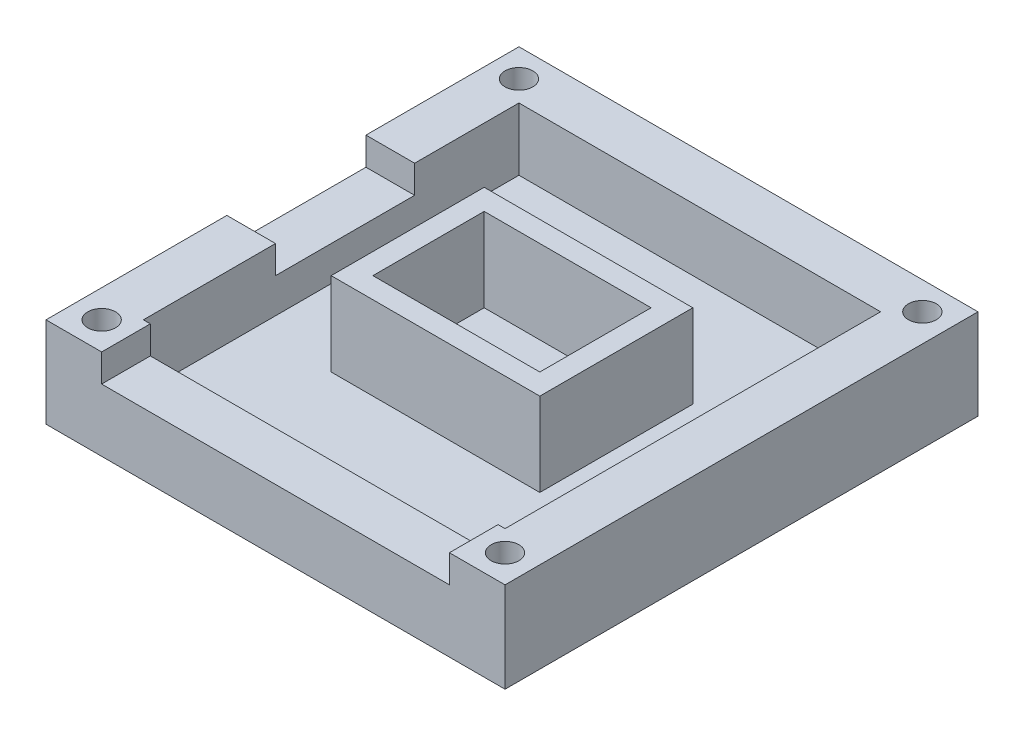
from build123d import *

# Parameters (mm, degrees)
BOSS_EXTRUDE1_DEPTH = 20
SKETCH2_W           = 33
SKETCH2_H           = 6.5
BOSS_EXTRUDE2_DEPTH = 7
SKETCH3_W           = 33
SKETCH3_H           = 6.5
BOSS_EXTRUDE3_DEPTH = 7
SKETCH4_W           = 26
SKETCH4_H           = 27
CUT_EXTRUDE1_DEPTH  = 4.5
SKETCH5_W           = 25
SKETCH5_H           = 4
CUT_EXTRUDE2_DEPTH  = 14
SKETCH6_W           = 10
SKETCH6_H           = 4
CUT_EXTRUDE3_DEPTH  = 8
SKETCH7_R           = 1
CUT_EXTRUDE4_DEPTH  = 3
SKETCH8_W           = 15
SKETCH8_H           = 11
SKETCH8_W_2         = 12
SKETCH8_H_2         = 8
BOSS_EXTRUDE4_DEPTH = 6


with BuildPart() as part:
    # Sketch1 → Boss-Extrude1 (new body)
    with BuildSketch(Plane.XY):
        Polygon((7.75, 2.1), (9.75, 2.1), (9.75, 0), (-9.75, 0), (-9.75, 2.1), (-7.75, 2.1), (-7.75, 4), (-16.5, 4), (-16.5, 10.5), (16.5, 10.5), (16.5, 4), (7.75, 4), align=None)
    extrude(amount=BOSS_EXTRUDE1_DEPTH)

    # Sketch2 → Boss-Extrude2 (add)
    with BuildSketch(Plane.XY.offset(20)):
        with Locations((0, 7.25)):
            Rectangle(SKETCH2_W, SKETCH2_H)
    extrude(amount=BOSS_EXTRUDE2_DEPTH)

    # Sketch3 → Boss-Extrude3 (add)
    with BuildSketch(Plane(origin=(0, 0, 0), x_dir=(-1, 0, 0), z_dir=(0, 0, -1))):
        with Locations((0, 7.25)):
            Rectangle(SKETCH3_W, SKETCH3_H)
    extrude(amount=BOSS_EXTRUDE3_DEPTH)

    # Sketch4 → Cut-Extrude1 (cut)
    with BuildSketch(Plane(origin=(0, 10.5, 0), x_dir=(1, 0, 0), z_dir=(0, 1, 0))):
        with Locations((0, -10)):
            Rectangle(SKETCH4_W, SKETCH4_H)
    extrude(amount=-CUT_EXTRUDE1_DEPTH, mode=Mode.SUBTRACT)

    # Sketch5 → Cut-Extrude2 (cut)
    with BuildSketch(Plane.XY.offset(27)):
        with Locations((0, 10.5)):
            Rectangle(SKETCH5_W, SKETCH5_H)
    extrude(amount=-CUT_EXTRUDE2_DEPTH, mode=Mode.SUBTRACT)

    # Sketch6 → Cut-Extrude3 (cut)
    with BuildSketch(Plane.ZY.offset(16.5)):
        with Locations((9, 10.5)):
            Rectangle(SKETCH6_W, SKETCH6_H)
    extrude(amount=-CUT_EXTRUDE3_DEPTH, mode=Mode.SUBTRACT)

    # Sketch7 → Cut-Extrude4 (cut)
    with BuildSketch(Plane(origin=(0, 10.5, 0), x_dir=(1, 0, 0), z_dir=(0, 1, 0))):
        with Locations(Location((-14.5, 5, 0), (0, 0, 270))):
            Circle(SKETCH7_R)
        with Locations(Location((14.5, 5, 0), (0, 0, 90))):
            Circle(SKETCH7_R)
        with Locations(Location((14.5, -25, 0), (0, 0, 270))):
            Circle(SKETCH7_R)
        with Locations(Location((-14.5, -25, 0), (0, 0, 90))):
            Circle(SKETCH7_R)
    extrude(amount=-CUT_EXTRUDE4_DEPTH, mode=Mode.SUBTRACT)

    # Sketch8 → Boss-Extrude4 (add)
    with BuildSketch(Plane(origin=(0, 6, 0), x_dir=(1, 0, 0), z_dir=(0, 1, 0))):
        with Locations((0, -10)):
            Rectangle(SKETCH8_W, SKETCH8_H)
        with Locations((0, -10)):
            Rectangle(SKETCH8_W_2, SKETCH8_H_2, mode=Mode.SUBTRACT)
    extrude(amount=BOSS_EXTRUDE4_DEPTH)


solid = part.part
